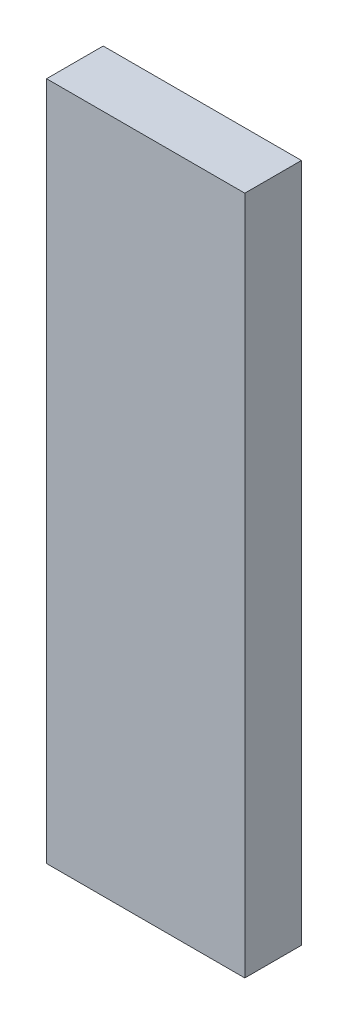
ISO-10303-21;
HEADER;
FILE_DESCRIPTION(('STEP AP214'),'2;1');
FILE_NAME('part.step','',(''),(''),'','','');
FILE_SCHEMA(('AUTOMOTIVE_DESIGN { 1 0 10303 214 1 1 1 1 }'));
ENDSEC;
DATA;
#1=APPLICATION_CONTEXT('core data for automotive mechanical design processes');
#2=APPLICATION_PROTOCOL_DEFINITION('international standard','automotive_design',2000,#1);
#3=PRODUCT_CONTEXT('',#1,'mechanical');
#4=PRODUCT('Part','Part','',(#3));
#5=PRODUCT_RELATED_PRODUCT_CATEGORY('part','',(#4));
#6=PRODUCT_DEFINITION_FORMATION('','',#4);
#7=PRODUCT_DEFINITION_CONTEXT('part definition',#1,'design');
#8=PRODUCT_DEFINITION('design','',#6,#7);
#9=PRODUCT_DEFINITION_SHAPE('','',#8);
#10=(LENGTH_UNIT() NAMED_UNIT(*) SI_UNIT(.MILLI.,.METRE.));
#11=(NAMED_UNIT(*) PLANE_ANGLE_UNIT() SI_UNIT($,.RADIAN.));
#12=(NAMED_UNIT(*) SI_UNIT($,.STERADIAN.) SOLID_ANGLE_UNIT());
#13=UNCERTAINTY_MEASURE_WITH_UNIT(LENGTH_MEASURE(1.E-05),#10,'distance_accuracy_value','');
#14=(GEOMETRIC_REPRESENTATION_CONTEXT(3) GLOBAL_UNCERTAINTY_ASSIGNED_CONTEXT((#13)) GLOBAL_UNIT_ASSIGNED_CONTEXT((#10,
#11,#12)) REPRESENTATION_CONTEXT('',''));
#15=CARTESIAN_POINT('',(0.,0.,0.));
#16=DIRECTION('',(0.,0.,1.));
#17=DIRECTION('',(1.,0.,0.));
#18=AXIS2_PLACEMENT_3D('',#15,#16,#17);
#19=CARTESIAN_POINT('',(66.675,457.2,-19.05));
#20=DIRECTION('',(-1.,0.,0.));
#21=DIRECTION('',(0.,0.,1.));
#22=AXIS2_PLACEMENT_3D('',#19,#20,#21);
#23=PLANE('',#22);
#24=DIRECTION('',(0.,0.,-1.));
#25=VECTOR('',#24,1.);
#26=CARTESIAN_POINT('',(66.675,0.,-19.05));
#27=LINE('',#26,#25);
#28=CARTESIAN_POINT('',(66.675,0.,19.05));
#29=VERTEX_POINT('',#28);
#30=CARTESIAN_POINT('',(66.675,0.,-19.05));
#31=VERTEX_POINT('',#30);
#32=EDGE_CURVE('E97',#29,#31,#27,.T.);
#33=ORIENTED_EDGE('',*,*,#32,.T.);
#34=DIRECTION('',(0.,-1.,0.));
#35=VECTOR('',#34,1.);
#36=CARTESIAN_POINT('',(66.675,457.2,-19.05));
#37=LINE('',#36,#35);
#38=CARTESIAN_POINT('',(66.675,457.2,-19.05));
#39=VERTEX_POINT('',#38);
#40=EDGE_CURVE('E11',#39,#31,#37,.T.);
#41=ORIENTED_EDGE('',*,*,#40,.F.);
#42=DIRECTION('',(0.,0.,-1.));
#43=VECTOR('',#42,1.);
#44=CARTESIAN_POINT('',(66.675,457.2,-19.05));
#45=LINE('',#44,#43);
#46=CARTESIAN_POINT('',(66.675,457.2,19.05));
#47=VERTEX_POINT('',#46);
#48=EDGE_CURVE('E85',#47,#39,#45,.T.);
#49=ORIENTED_EDGE('',*,*,#48,.F.);
#50=DIRECTION('',(0.,-1.,0.));
#51=VECTOR('',#50,1.);
#52=CARTESIAN_POINT('',(66.675,457.2,19.05));
#53=LINE('',#52,#51);
#54=EDGE_CURVE('E93',#47,#29,#53,.T.);
#55=ORIENTED_EDGE('',*,*,#54,.T.);
#56=EDGE_LOOP('',(#33,#41,#49,#55));
#57=FACE_BOUND('',#56,.T.);
#58=ADVANCED_FACE('F34',(#57),#23,.F.);
#59=CARTESIAN_POINT('',(-66.675,457.2,-19.05));
#60=DIRECTION('',(0.,0.,1.));
#61=DIRECTION('',(1.,0.,0.));
#62=AXIS2_PLACEMENT_3D('',#59,#60,#61);
#63=PLANE('',#62);
#64=DIRECTION('',(-1.,0.,0.));
#65=VECTOR('',#64,1.);
#66=CARTESIAN_POINT('',(-66.675,0.,-19.05));
#67=LINE('',#66,#65);
#68=CARTESIAN_POINT('',(-66.675,0.,-19.05));
#69=VERTEX_POINT('',#68);
#70=EDGE_CURVE('E89',#31,#69,#67,.T.);
#71=ORIENTED_EDGE('',*,*,#70,.T.);
#72=DIRECTION('',(0.,-1.,0.));
#73=VECTOR('',#72,1.);
#74=CARTESIAN_POINT('',(-66.675,457.2,-19.05));
#75=LINE('',#74,#73);
#76=CARTESIAN_POINT('',(-66.675,457.2,-19.05));
#77=VERTEX_POINT('',#76);
#78=EDGE_CURVE('E42',#77,#69,#75,.T.);
#79=ORIENTED_EDGE('',*,*,#78,.F.);
#80=DIRECTION('',(-1.,0.,0.));
#81=VECTOR('',#80,1.);
#82=CARTESIAN_POINT('',(-66.675,457.2,-19.05));
#83=LINE('',#82,#81);
#84=EDGE_CURVE('E80',#39,#77,#83,.T.);
#85=ORIENTED_EDGE('',*,*,#84,.F.);
#86=ORIENTED_EDGE('',*,*,#40,.T.);
#87=EDGE_LOOP('',(#71,#79,#85,#86));
#88=FACE_BOUND('',#87,.T.);
#89=ADVANCED_FACE('F88',(#88),#63,.F.);
#90=CARTESIAN_POINT('',(-66.675,457.2,-19.05));
#91=DIRECTION('',(1.,0.,0.));
#92=DIRECTION('',(0.,0.,-1.));
#93=AXIS2_PLACEMENT_3D('',#90,#91,#92);
#94=PLANE('',#93);
#95=DIRECTION('',(0.,0.,1.));
#96=VECTOR('',#95,1.);
#97=CARTESIAN_POINT('',(-66.675,0.,-19.05));
#98=LINE('',#97,#96);
#99=CARTESIAN_POINT('',(-66.675,0.,19.05));
#100=VERTEX_POINT('',#99);
#101=EDGE_CURVE('E67',#69,#100,#98,.T.);
#102=ORIENTED_EDGE('',*,*,#101,.T.);
#103=DIRECTION('',(0.,-1.,0.));
#104=VECTOR('',#103,1.);
#105=CARTESIAN_POINT('',(-66.675,457.2,19.05));
#106=LINE('',#105,#104);
#107=CARTESIAN_POINT('',(-66.675,457.2,19.05));
#108=VERTEX_POINT('',#107);
#109=EDGE_CURVE('E90',#108,#100,#106,.T.);
#110=ORIENTED_EDGE('',*,*,#109,.F.);
#111=DIRECTION('',(0.,0.,1.));
#112=VECTOR('',#111,1.);
#113=CARTESIAN_POINT('',(-66.675,457.2,-19.05));
#114=LINE('',#113,#112);
#115=EDGE_CURVE('E83',#77,#108,#114,.T.);
#116=ORIENTED_EDGE('',*,*,#115,.F.);
#117=ORIENTED_EDGE('',*,*,#78,.T.);
#118=EDGE_LOOP('',(#102,#110,#116,#117));
#119=FACE_BOUND('',#118,.T.);
#120=ADVANCED_FACE('F91',(#119),#94,.F.);
#121=CARTESIAN_POINT('',(-66.675,457.2,19.05));
#122=DIRECTION('',(0.,0.,-1.));
#123=DIRECTION('',(-1.,0.,0.));
#124=AXIS2_PLACEMENT_3D('',#121,#122,#123);
#125=PLANE('',#124);
#126=DIRECTION('',(1.,0.,0.));
#127=VECTOR('',#126,1.);
#128=CARTESIAN_POINT('',(-66.675,0.,19.05));
#129=LINE('',#128,#127);
#130=EDGE_CURVE('E73',#100,#29,#129,.T.);
#131=ORIENTED_EDGE('',*,*,#130,.T.);
#132=ORIENTED_EDGE('',*,*,#54,.F.);
#133=DIRECTION('',(1.,0.,0.));
#134=VECTOR('',#133,1.);
#135=CARTESIAN_POINT('',(-66.675,457.2,19.05));
#136=LINE('',#135,#134);
#137=EDGE_CURVE('E50',#108,#47,#136,.T.);
#138=ORIENTED_EDGE('',*,*,#137,.F.);
#139=ORIENTED_EDGE('',*,*,#109,.T.);
#140=EDGE_LOOP('',(#131,#132,#138,#139));
#141=FACE_BOUND('',#140,.T.);
#142=ADVANCED_FACE('F104',(#141),#125,.F.);
#143=CARTESIAN_POINT('',(0.,457.2,0.));
#144=DIRECTION('',(0.,1.,0.));
#145=DIRECTION('',(0.,0.,1.));
#146=AXIS2_PLACEMENT_3D('',#143,#144,#145);
#147=PLANE('',#146);
#148=ORIENTED_EDGE('',*,*,#48,.T.);
#149=ORIENTED_EDGE('',*,*,#84,.T.);
#150=ORIENTED_EDGE('',*,*,#115,.T.);
#151=ORIENTED_EDGE('',*,*,#137,.T.);
#152=EDGE_LOOP('',(#148,#149,#150,#151));
#153=FACE_BOUND('',#152,.T.);
#154=ADVANCED_FACE('F81',(#153),#147,.T.);
#155=CARTESIAN_POINT('',(0.,0.,0.));
#156=DIRECTION('',(0.,1.,0.));
#157=DIRECTION('',(0.,0.,1.));
#158=AXIS2_PLACEMENT_3D('',#155,#156,#157);
#159=PLANE('',#158);
#160=ORIENTED_EDGE('',*,*,#32,.F.);
#161=ORIENTED_EDGE('',*,*,#130,.F.);
#162=ORIENTED_EDGE('',*,*,#101,.F.);
#163=ORIENTED_EDGE('',*,*,#70,.F.);
#164=EDGE_LOOP('',(#160,#161,#162,#163));
#165=FACE_BOUND('',#164,.T.);
#166=ADVANCED_FACE('F107',(#165),#159,.F.);
#167=CLOSED_SHELL('',(#58,#89,#120,#142,#154,#166));
#168=MANIFOLD_SOLID_BREP('B2',#167);
#169=ADVANCED_BREP_SHAPE_REPRESENTATION('',(#18,#168),#14);
#170=SHAPE_DEFINITION_REPRESENTATION(#9,#169);
ENDSEC;
END-ISO-10303-21;
